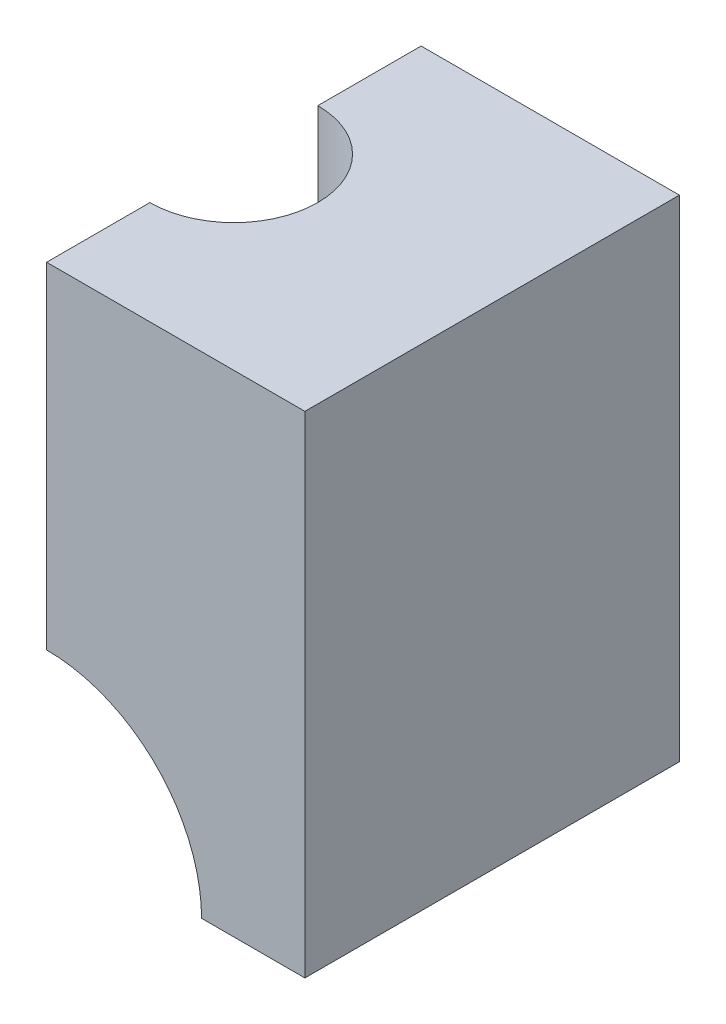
ISO-10303-21;
HEADER;
FILE_DESCRIPTION(('STEP AP214'),'2;1');
FILE_NAME('part.step','',(''),(''),'','','');
FILE_SCHEMA(('AUTOMOTIVE_DESIGN { 1 0 10303 214 1 1 1 1 }'));
ENDSEC;
DATA;
#1=APPLICATION_CONTEXT('core data for automotive mechanical design processes');
#2=APPLICATION_PROTOCOL_DEFINITION('international standard','automotive_design',2000,#1);
#3=PRODUCT_CONTEXT('',#1,'mechanical');
#4=PRODUCT('Part','Part','',(#3));
#5=PRODUCT_RELATED_PRODUCT_CATEGORY('part','',(#4));
#6=PRODUCT_DEFINITION_FORMATION('','',#4);
#7=PRODUCT_DEFINITION_CONTEXT('part definition',#1,'design');
#8=PRODUCT_DEFINITION('design','',#6,#7);
#9=PRODUCT_DEFINITION_SHAPE('','',#8);
#10=(LENGTH_UNIT() NAMED_UNIT(*) SI_UNIT(.MILLI.,.METRE.));
#11=(NAMED_UNIT(*) PLANE_ANGLE_UNIT() SI_UNIT($,.RADIAN.));
#12=(NAMED_UNIT(*) SI_UNIT($,.STERADIAN.) SOLID_ANGLE_UNIT());
#13=UNCERTAINTY_MEASURE_WITH_UNIT(LENGTH_MEASURE(1.E-05),#10,'distance_accuracy_value','');
#14=(GEOMETRIC_REPRESENTATION_CONTEXT(3) GLOBAL_UNCERTAINTY_ASSIGNED_CONTEXT((#13)) GLOBAL_UNIT_ASSIGNED_CONTEXT((#10,
#11,#12)) REPRESENTATION_CONTEXT('',''));
#15=CARTESIAN_POINT('',(0.,0.,0.));
#16=DIRECTION('',(0.,0.,1.));
#17=DIRECTION('',(1.,0.,0.));
#18=AXIS2_PLACEMENT_3D('',#15,#16,#17);
#19=CARTESIAN_POINT('',(-396.363758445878,77.7780315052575,458.902522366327));
#20=DIRECTION('',(1.,0.,0.));
#21=DIRECTION('',(0.,0.,-1.));
#22=AXIS2_PLACEMENT_3D('',#19,#20,#21);
#23=PLANE('',#22);
#24=DIRECTION('',(0.,0.,1.));
#25=VECTOR('',#24,1.);
#26=CARTESIAN_POINT('',(-396.363758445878,-182.221968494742,168.902522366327));
#27=LINE('',#26,#25);
#28=CARTESIAN_POINT('',(-396.363758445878,-182.221968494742,168.902522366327));
#29=VERTEX_POINT('',#28);
#30=CARTESIAN_POINT('',(-396.363758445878,-182.221968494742,248.902522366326));
#31=VERTEX_POINT('',#30);
#32=EDGE_CURVE('E27',#29,#31,#27,.T.);
#33=ORIENTED_EDGE('',*,*,#32,.T.);
#34=DIRECTION('',(0.,1.,0.));
#35=VECTOR('',#34,1.);
#36=CARTESIAN_POINT('',(-396.363758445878,-302.221968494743,248.902522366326));
#37=LINE('',#36,#35);
#38=CARTESIAN_POINT('',(-396.363758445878,77.7780315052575,248.902522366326));
#39=VERTEX_POINT('',#38);
#40=EDGE_CURVE('E34',#31,#39,#37,.T.);
#41=ORIENTED_EDGE('',*,*,#40,.T.);
#42=DIRECTION('',(0.,0.,1.));
#43=VECTOR('',#42,1.);
#44=CARTESIAN_POINT('',(-396.363758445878,77.7780315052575,168.902522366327));
#45=LINE('',#44,#43);
#46=CARTESIAN_POINT('',(-396.363758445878,77.7780315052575,168.902522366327));
#47=VERTEX_POINT('',#46);
#48=EDGE_CURVE('E88',#47,#39,#45,.T.);
#49=ORIENTED_EDGE('',*,*,#48,.F.);
#50=DIRECTION('',(0.,-1.,0.));
#51=VECTOR('',#50,1.);
#52=CARTESIAN_POINT('',(-396.363758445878,77.7780315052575,168.902522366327));
#53=LINE('',#52,#51);
#54=EDGE_CURVE('E95',#47,#29,#53,.T.);
#55=ORIENTED_EDGE('',*,*,#54,.T.);
#56=EDGE_LOOP('',(#33,#41,#49,#55));
#57=FACE_BOUND('',#56,.T.);
#58=ADVANCED_FACE('F14',(#57),#23,.F.);
#59=CARTESIAN_POINT('',(-196.363758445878,-302.221968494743,458.902522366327));
#60=DIRECTION('',(0.,0.,1.));
#61=DIRECTION('',(1.,0.,0.));
#62=AXIS2_PLACEMENT_3D('',#59,#60,#61);
#63=PLANE('',#62);
#64=CARTESIAN_POINT('',(-396.363758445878,-302.221968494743,458.902522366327));
#65=DIRECTION('',(0.,0.,1.));
#66=DIRECTION('',(1.,0.,0.));
#67=AXIS2_PLACEMENT_3D('',#64,#65,#66);
#68=CIRCLE('',#67,120.);
#69=CARTESIAN_POINT('',(-276.363758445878,-302.221968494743,458.902522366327));
#70=VERTEX_POINT('',#69);
#71=CARTESIAN_POINT('',(-396.363758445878,-182.221968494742,458.902522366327));
#72=VERTEX_POINT('',#71);
#73=EDGE_CURVE('E132',#70,#72,#68,.T.);
#74=ORIENTED_EDGE('',*,*,#73,.F.);
#75=DIRECTION('',(-1.,0.,0.));
#76=VECTOR('',#75,1.);
#77=CARTESIAN_POINT('',(-196.363758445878,-302.221968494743,458.902522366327));
#78=LINE('',#77,#76);
#79=CARTESIAN_POINT('',(-196.363758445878,-302.221968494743,458.902522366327));
#80=VERTEX_POINT('',#79);
#81=EDGE_CURVE('E113',#80,#70,#78,.T.);
#82=ORIENTED_EDGE('',*,*,#81,.F.);
#83=DIRECTION('',(0.,1.,0.));
#84=VECTOR('',#83,1.);
#85=CARTESIAN_POINT('',(-196.363758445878,-302.221968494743,458.902522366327));
#86=LINE('',#85,#84);
#87=CARTESIAN_POINT('',(-196.363758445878,77.7780315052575,458.902522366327));
#88=VERTEX_POINT('',#87);
#89=EDGE_CURVE('E102',#80,#88,#86,.T.);
#90=ORIENTED_EDGE('',*,*,#89,.T.);
#91=DIRECTION('',(-1.,0.,0.));
#92=VECTOR('',#91,1.);
#93=CARTESIAN_POINT('',(-196.363758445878,77.7780315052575,458.902522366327));
#94=LINE('',#93,#92);
#95=CARTESIAN_POINT('',(-396.363758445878,77.7780315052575,458.902522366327));
#96=VERTEX_POINT('',#95);
#97=EDGE_CURVE('E112',#88,#96,#94,.T.);
#98=ORIENTED_EDGE('',*,*,#97,.T.);
#99=DIRECTION('',(0.,1.,0.));
#100=VECTOR('',#99,1.);
#101=CARTESIAN_POINT('',(-396.363758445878,-302.221968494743,458.902522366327));
#102=LINE('',#101,#100);
#103=EDGE_CURVE('E92',#72,#96,#102,.T.);
#104=ORIENTED_EDGE('',*,*,#103,.F.);
#105=EDGE_LOOP('',(#74,#82,#90,#98,#104));
#106=FACE_BOUND('',#105,.T.);
#107=ADVANCED_FACE('F16',(#106),#63,.T.);
#108=CARTESIAN_POINT('',(-196.363758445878,-302.221968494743,458.902522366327));
#109=DIRECTION('',(0.,1.,0.));
#110=DIRECTION('',(0.,0.,-1.));
#111=AXIS2_PLACEMENT_3D('',#108,#109,#110);
#112=PLANE('',#111);
#113=ORIENTED_EDGE('',*,*,#81,.T.);
#114=DIRECTION('',(0.,0.,1.));
#115=VECTOR('',#114,1.);
#116=CARTESIAN_POINT('',(-276.363758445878,-302.221968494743,168.902522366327));
#117=LINE('',#116,#115);
#118=CARTESIAN_POINT('',(-276.363758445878,-302.221968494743,168.902522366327));
#119=VERTEX_POINT('',#118);
#120=EDGE_CURVE('E96',#70,#119,#117,.F.);
#121=ORIENTED_EDGE('',*,*,#120,.T.);
#122=DIRECTION('',(-1.,0.,0.));
#123=VECTOR('',#122,1.);
#124=CARTESIAN_POINT('',(-196.363758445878,-302.221968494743,168.902522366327));
#125=LINE('',#124,#123);
#126=CARTESIAN_POINT('',(-196.363758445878,-302.221968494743,168.902522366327));
#127=VERTEX_POINT('',#126);
#128=EDGE_CURVE('E116',#127,#119,#125,.T.);
#129=ORIENTED_EDGE('',*,*,#128,.F.);
#130=DIRECTION('',(0.,0.,-1.));
#131=VECTOR('',#130,1.);
#132=CARTESIAN_POINT('',(-196.363758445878,-302.221968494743,458.902522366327));
#133=LINE('',#132,#131);
#134=EDGE_CURVE('E110',#80,#127,#133,.T.);
#135=ORIENTED_EDGE('',*,*,#134,.F.);
#136=EDGE_LOOP('',(#113,#121,#129,#135));
#137=FACE_BOUND('',#136,.T.);
#138=ADVANCED_FACE('F145',(#137),#112,.F.);
#139=CARTESIAN_POINT('',(-196.363758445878,77.7780315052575,168.902522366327));
#140=DIRECTION('',(0.,0.,-1.));
#141=DIRECTION('',(0.,-1.,0.));
#142=AXIS2_PLACEMENT_3D('',#139,#140,#141);
#143=PLANE('',#142);
#144=CARTESIAN_POINT('',(-396.363758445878,-302.221968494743,168.902522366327));
#145=DIRECTION('',(0.,0.,1.));
#146=DIRECTION('',(1.,0.,0.));
#147=AXIS2_PLACEMENT_3D('',#144,#145,#146);
#148=CIRCLE('',#147,120.);
#149=EDGE_CURVE('E127',#119,#29,#148,.T.);
#150=ORIENTED_EDGE('',*,*,#149,.T.);
#151=ORIENTED_EDGE('',*,*,#54,.F.);
#152=DIRECTION('',(-1.,0.,0.));
#153=VECTOR('',#152,1.);
#154=CARTESIAN_POINT('',(-196.363758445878,77.7780315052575,168.902522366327));
#155=LINE('',#154,#153);
#156=CARTESIAN_POINT('',(-196.363758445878,77.7780315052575,168.902522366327));
#157=VERTEX_POINT('',#156);
#158=EDGE_CURVE('E119',#157,#47,#155,.T.);
#159=ORIENTED_EDGE('',*,*,#158,.F.);
#160=DIRECTION('',(0.,-1.,0.));
#161=VECTOR('',#160,1.);
#162=CARTESIAN_POINT('',(-196.363758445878,77.7780315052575,168.902522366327));
#163=LINE('',#162,#161);
#164=EDGE_CURVE('E107',#157,#127,#163,.T.);
#165=ORIENTED_EDGE('',*,*,#164,.T.);
#166=ORIENTED_EDGE('',*,*,#128,.T.);
#167=EDGE_LOOP('',(#150,#151,#159,#165,#166));
#168=FACE_BOUND('',#167,.T.);
#169=ADVANCED_FACE('F130',(#168),#143,.T.);
#170=CARTESIAN_POINT('',(-196.363758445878,77.7780315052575,168.902522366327));
#171=DIRECTION('',(0.,-1.,0.));
#172=DIRECTION('',(1.,0.,0.));
#173=AXIS2_PLACEMENT_3D('',#170,#171,#172);
#174=PLANE('',#173);
#175=ORIENTED_EDGE('',*,*,#48,.T.);
#176=CARTESIAN_POINT('',(-396.363758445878,77.7780315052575,313.902522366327));
#177=DIRECTION('',(0.,1.,0.));
#178=DIRECTION('',(-1.,0.,0.));
#179=AXIS2_PLACEMENT_3D('',#176,#177,#178);
#180=CIRCLE('',#179,65.);
#181=CARTESIAN_POINT('',(-396.363758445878,77.7780315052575,378.902522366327));
#182=VERTEX_POINT('',#181);
#183=EDGE_CURVE('E79',#182,#39,#180,.T.);
#184=ORIENTED_EDGE('',*,*,#183,.F.);
#185=EDGE_CURVE('E86',#182,#96,#45,.T.);
#186=ORIENTED_EDGE('',*,*,#185,.T.);
#187=ORIENTED_EDGE('',*,*,#97,.F.);
#188=DIRECTION('',(0.,0.,1.));
#189=VECTOR('',#188,1.);
#190=CARTESIAN_POINT('',(-196.363758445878,77.7780315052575,168.902522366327));
#191=LINE('',#190,#189);
#192=EDGE_CURVE('E105',#157,#88,#191,.T.);
#193=ORIENTED_EDGE('',*,*,#192,.F.);
#194=ORIENTED_EDGE('',*,*,#158,.T.);
#195=EDGE_LOOP('',(#175,#184,#186,#187,#193,#194));
#196=FACE_BOUND('',#195,.T.);
#197=ADVANCED_FACE('F84',(#196),#174,.F.);
#198=CARTESIAN_POINT('',(-196.363758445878,77.7780315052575,458.902522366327));
#199=DIRECTION('',(1.,0.,0.));
#200=DIRECTION('',(0.,0.,-1.));
#201=AXIS2_PLACEMENT_3D('',#198,#199,#200);
#202=PLANE('',#201);
#203=ORIENTED_EDGE('',*,*,#89,.F.);
#204=ORIENTED_EDGE('',*,*,#134,.T.);
#205=ORIENTED_EDGE('',*,*,#164,.F.);
#206=ORIENTED_EDGE('',*,*,#192,.T.);
#207=EDGE_LOOP('',(#203,#204,#205,#206));
#208=FACE_BOUND('',#207,.T.);
#209=ADVANCED_FACE('F142',(#208),#202,.T.);
#210=ORIENTED_EDGE('',*,*,#185,.F.);
#211=DIRECTION('',(0.,1.,0.));
#212=VECTOR('',#211,1.);
#213=CARTESIAN_POINT('',(-396.363758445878,-302.221968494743,378.902522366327));
#214=LINE('',#213,#212);
#215=CARTESIAN_POINT('',(-396.363758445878,-182.221968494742,378.902522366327));
#216=VERTEX_POINT('',#215);
#217=EDGE_CURVE('E76',#182,#216,#214,.F.);
#218=ORIENTED_EDGE('',*,*,#217,.T.);
#219=EDGE_CURVE('E41',#216,#72,#27,.T.);
#220=ORIENTED_EDGE('',*,*,#219,.T.);
#221=ORIENTED_EDGE('',*,*,#103,.T.);
#222=EDGE_LOOP('',(#210,#218,#220,#221));
#223=FACE_BOUND('',#222,.T.);
#224=ADVANCED_FACE('F90',(#223),#23,.F.);
#225=CARTESIAN_POINT('',(-396.363758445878,-302.221968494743,168.902522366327));
#226=DIRECTION('',(0.,0.,1.));
#227=DIRECTION('',(1.,0.,0.));
#228=AXIS2_PLACEMENT_3D('',#225,#226,#227);
#229=CYLINDRICAL_SURFACE('',#228,120.);
#230=ORIENTED_EDGE('',*,*,#219,.F.);
#231=CARTESIAN_POINT('',(-461.363758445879,-201.350763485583,313.902522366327));
#232=CARTESIAN_POINT('',(-461.363759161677,-201.35076442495,314.738076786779));
#233=CARTESIAN_POINT('',(-461.347642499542,-201.340373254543,315.573614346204));
#234=CARTESIAN_POINT('',(-461.283238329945,-201.298915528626,317.243020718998));
#235=CARTESIAN_POINT('',(-461.234947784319,-201.267847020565,318.076889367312));
#236=CARTESIAN_POINT('',(-461.106365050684,-201.185337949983,319.741341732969));
#237=CARTESIAN_POINT('',(-461.026065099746,-201.133892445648,320.57192460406));
#238=CARTESIAN_POINT('',(-460.833759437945,-201.011139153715,322.228023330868));
#239=CARTESIAN_POINT('',(-460.721750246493,-200.939829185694,323.053538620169));
#240=CARTESIAN_POINT('',(-460.466263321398,-200.777935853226,324.698956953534));
#241=CARTESIAN_POINT('',(-460.322742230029,-200.687325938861,325.518850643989));
#242=CARTESIAN_POINT('',(-460.004808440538,-200.487746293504,327.150453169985));
#243=CARTESIAN_POINT('',(-459.830392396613,-200.378774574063,327.962161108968));
#244=CARTESIAN_POINT('',(-459.451281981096,-200.143497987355,329.575781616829));
#245=CARTESIAN_POINT('',(-459.246593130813,-200.017196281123,330.377695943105));
#246=CARTESIAN_POINT('',(-458.807542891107,-199.748362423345,331.970633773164));
#247=CARTESIAN_POINT('',(-458.573178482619,-199.605828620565,332.761656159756));
#248=CARTESIAN_POINT('',(-457.829652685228,-199.157531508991,335.106794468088));
#249=CARTESIAN_POINT('',(-457.277612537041,-198.829534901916,336.643344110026));
#250=CARTESIAN_POINT('',(-456.064380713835,-198.124286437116,339.660650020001));
#251=CARTESIAN_POINT('',(-455.403187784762,-197.747034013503,341.141405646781));
#252=CARTESIAN_POINT('',(-453.976861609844,-196.953758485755,344.041218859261));
#253=CARTESIAN_POINT('',(-453.211723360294,-196.537733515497,345.460273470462));
#254=CARTESIAN_POINT('',(-451.582525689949,-195.677441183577,348.231397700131));
#255=CARTESIAN_POINT('',(-450.718461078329,-195.233172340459,349.583463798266));
#256=CARTESIAN_POINT('',(-448.806793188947,-194.282280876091,352.34490919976));
#257=CARTESIAN_POINT('',(-447.749504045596,-193.7738101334,353.746955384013));
#258=CARTESIAN_POINT('',(-445.526798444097,-192.748256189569,356.459191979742));
#259=CARTESIAN_POINT('',(-444.361376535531,-192.231172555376,357.769377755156));
#260=CARTESIAN_POINT('',(-441.92700399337,-191.200627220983,360.292881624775));
#261=CARTESIAN_POINT('',(-440.657997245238,-190.68716764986,361.506146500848));
#262=CARTESIAN_POINT('',(-438.022401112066,-189.676198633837,363.828904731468));
#263=CARTESIAN_POINT('',(-436.655808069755,-189.178689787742,364.938394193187));
#264=CARTESIAN_POINT('',(-433.713474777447,-188.171057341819,367.134465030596));
#265=CARTESIAN_POINT('',(-432.129785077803,-187.663295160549,368.211557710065));
#266=CARTESIAN_POINT('',(-429.680191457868,-186.936486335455,369.723101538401));
#267=CARTESIAN_POINT('',(-428.851149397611,-186.699980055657,370.209684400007));
#268=CARTESIAN_POINT('',(-427.169506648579,-186.240223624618,371.147016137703));
#269=CARTESIAN_POINT('',(-426.316908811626,-186.016971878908,371.597769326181));
#270=CARTESIAN_POINT('',(-424.589845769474,-185.585438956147,372.462065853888));
#271=CARTESIAN_POINT('',(-423.715390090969,-185.377151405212,372.875625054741));
#272=CARTESIAN_POINT('',(-421.945830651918,-184.977010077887,373.664515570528));
#273=CARTESIAN_POINT('',(-421.050729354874,-184.785154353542,374.03985141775));
#274=CARTESIAN_POINT('',(-419.241462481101,-184.419326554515,374.751149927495));
#275=CARTESIAN_POINT('',(-418.327297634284,-184.24535379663,375.087114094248));
#276=CARTESIAN_POINT('',(-416.481685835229,-183.916653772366,375.718541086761));
#277=CARTESIAN_POINT('',(-415.55023927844,-183.761926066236,376.014004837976));
#278=CARTESIAN_POINT('',(-413.748291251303,-183.484694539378,376.541058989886));
#279=CARTESIAN_POINT('',(-412.878981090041,-183.360594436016,376.77588754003));
#280=CARTESIAN_POINT('',(-411.128999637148,-183.130547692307,377.209712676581));
#281=CARTESIAN_POINT('',(-410.248327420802,-183.024602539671,377.40870632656));
#282=CARTESIAN_POINT('',(-408.477524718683,-182.831642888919,377.770144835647));
#283=CARTESIAN_POINT('',(-407.587394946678,-182.744626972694,377.932592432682));
#284=CARTESIAN_POINT('',(-405.799474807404,-182.59014846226,378.220382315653));
#285=CARTESIAN_POINT('',(-404.901684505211,-182.522685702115,378.345724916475));
#286=CARTESIAN_POINT('',(-403.100870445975,-182.407842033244,378.558790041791));
#287=CARTESIAN_POINT('',(-402.197849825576,-182.360450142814,378.646533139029));
#288=CARTESIAN_POINT('',(-400.388187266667,-182.28605237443,378.784163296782));
#289=CARTESIAN_POINT('',(-399.48154573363,-182.259044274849,378.834054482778));
#290=CARTESIAN_POINT('',(-397.666597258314,-182.225608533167,378.895807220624));
#291=CARTESIAN_POINT('',(-396.758290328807,-182.219180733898,378.907669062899));
#292=CARTESIAN_POINT('',(-394.942079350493,-182.226954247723,378.893317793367));
#293=CARTESIAN_POINT('',(-394.034175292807,-182.241155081,378.867105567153));
#294=CARTESIAN_POINT('',(-392.313199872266,-182.287583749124,378.781315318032));
#295=CARTESIAN_POINT('',(-391.499889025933,-182.317827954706,378.725408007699));
#296=CARTESIAN_POINT('',(-389.876646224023,-182.39468594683,378.583131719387));
#297=CARTESIAN_POINT('',(-389.066714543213,-182.441301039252,378.496760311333));
#298=CARTESIAN_POINT('',(-387.451869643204,-182.550614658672,378.293828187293));
#299=CARTESIAN_POINT('',(-386.646955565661,-182.613310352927,378.177272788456));
#300=CARTESIAN_POINT('',(-385.043381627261,-182.754410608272,377.914314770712));
#301=CARTESIAN_POINT('',(-384.244722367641,-182.832816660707,377.767909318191));
#302=CARTESIAN_POINT('',(-381.860276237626,-183.090937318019,377.284521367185));
#303=CARTESIAN_POINT('',(-380.285642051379,-183.293580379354,376.903319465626));
#304=CARTESIAN_POINT('',(-377.177064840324,-183.755341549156,376.02723495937));
#305=CARTESIAN_POINT('',(-375.643123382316,-184.014461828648,375.532347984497));
#306=CARTESIAN_POINT('',(-372.60737816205,-184.586740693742,374.427497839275));
#307=CARTESIAN_POINT('',(-371.106134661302,-184.900477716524,373.816295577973));
#308=CARTESIAN_POINT('',(-368.161884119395,-185.573200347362,372.488040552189));
#309=CARTESIAN_POINT('',(-366.718876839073,-185.932185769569,371.770988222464));
#310=CARTESIAN_POINT('',(-363.897332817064,-186.688142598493,370.236444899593));
#311=CARTESIAN_POINT('',(-362.518810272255,-187.085122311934,369.418931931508));
#312=CARTESIAN_POINT('',(-359.832091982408,-187.909185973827,367.689050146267));
#313=CARTESIAN_POINT('',(-358.523900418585,-188.336271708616,366.776675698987));
#314=CARTESIAN_POINT('',(-355.848192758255,-189.258711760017,364.760986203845));
#315=CARTESIAN_POINT('',(-354.48903439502,-189.756509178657,363.647682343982));
#316=CARTESIAN_POINT('',(-351.868253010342,-190.76738972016,361.317968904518));
#317=CARTESIAN_POINT('',(-350.606635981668,-191.280473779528,360.101552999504));
#318=CARTESIAN_POINT('',(-348.185126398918,-192.310403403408,357.570471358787));
#319=CARTESIAN_POINT('',(-347.025329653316,-192.827252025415,356.2557151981));
#320=CARTESIAN_POINT('',(-344.814044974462,-193.851713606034,353.534588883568));
#321=CARTESIAN_POINT('',(-343.762561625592,-194.359326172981,352.12821485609));
#322=CARTESIAN_POINT('',(-341.690311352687,-195.39376465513,349.108243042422));
#323=CARTESIAN_POINT('',(-340.6794700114,-195.918646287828,347.487151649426));
#324=CARTESIAN_POINT('',(-338.799248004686,-196.924937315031,344.151344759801));
#325=CARTESIAN_POINT('',(-337.929878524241,-197.406343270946,342.436621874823));
#326=CARTESIAN_POINT('',(-336.739120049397,-198.082107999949,339.802921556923));
#327=CARTESIAN_POINT('',(-336.361175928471,-198.299582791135,338.915017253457));
#328=CARTESIAN_POINT('',(-335.64394998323,-198.717007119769,337.119731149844));
#329=CARTESIAN_POINT('',(-335.304663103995,-198.916958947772,336.212351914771));
#330=CARTESIAN_POINT('',(-334.66586855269,-199.297197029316,334.379636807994));
#331=CARTESIAN_POINT('',(-334.366361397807,-199.477483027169,333.454300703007));
#332=CARTESIAN_POINT('',(-333.808280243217,-199.816310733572,331.587570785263));
#333=CARTESIAN_POINT('',(-333.54969994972,-199.974855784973,330.646179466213));
#334=CARTESIAN_POINT('',(-333.093710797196,-200.25645012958,328.825952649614));
#335=CARTESIAN_POINT('',(-332.893046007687,-200.38133313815,327.948215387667));
#336=CARTESIAN_POINT('',(-332.527936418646,-200.609792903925,326.182601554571));
#337=CARTESIAN_POINT('',(-332.363486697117,-200.713372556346,325.294726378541));
#338=CARTESIAN_POINT('',(-332.071440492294,-200.898093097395,323.510590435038));
#339=CARTESIAN_POINT('',(-331.943844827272,-200.979233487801,322.614329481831));
#340=CARTESIAN_POINT('',(-331.726059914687,-201.118137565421,320.815463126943));
#341=CARTESIAN_POINT('',(-331.635870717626,-201.175901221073,319.912857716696));
#342=CARTESIAN_POINT('',(-331.493367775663,-201.267327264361,318.104250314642));
#343=CARTESIAN_POINT('',(-331.44102042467,-201.30101103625,317.198252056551));
#344=CARTESIAN_POINT('',(-331.374312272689,-201.343955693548,315.384281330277));
#345=CARTESIAN_POINT('',(-331.359951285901,-201.353216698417,314.476308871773));
#346=CARTESIAN_POINT('',(-331.369281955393,-201.347204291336,312.660717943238));
#347=CARTESIAN_POINT('',(-331.392970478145,-201.331932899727,311.753099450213));
#348=CARTESIAN_POINT('',(-331.478282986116,-201.277044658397,309.940411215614));
#349=CARTESIAN_POINT('',(-331.539905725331,-201.237428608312,309.035341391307));
#350=CARTESIAN_POINT('',(-331.689600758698,-201.141505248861,307.355623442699));
#351=CARTESIAN_POINT('',(-331.772796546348,-201.088289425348,306.580359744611));
#352=CARTESIAN_POINT('',(-331.966802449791,-200.964647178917,305.03465605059));
#353=CARTESIAN_POINT('',(-332.07761479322,-200.894219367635,304.264216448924));
#354=CARTESIAN_POINT('',(-332.450938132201,-200.658000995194,301.962418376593));
#355=CARTESIAN_POINT('',(-332.75438782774,-200.46724140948,300.439996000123));
#356=CARTESIAN_POINT('',(-333.466915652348,-200.025284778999,297.428817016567));
#357=CARTESIAN_POINT('',(-333.876028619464,-199.774067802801,295.940071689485));
#358=CARTESIAN_POINT('',(-334.795657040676,-199.21877832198,293.004315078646));
#359=CARTESIAN_POINT('',(-335.306179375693,-198.914702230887,291.557306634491));
#360=CARTESIAN_POINT('',(-336.448307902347,-198.24796000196,288.650148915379));
#361=CARTESIAN_POINT('',(-337.084194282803,-197.883329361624,287.192135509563));
#362=CARTESIAN_POINT('',(-338.456395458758,-197.11556924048,284.334813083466));
#363=CARTESIAN_POINT('',(-339.192711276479,-196.712439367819,282.935504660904));
#364=CARTESIAN_POINT('',(-340.761332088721,-195.877435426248,280.20004440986));
#365=CARTESIAN_POINT('',(-341.593673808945,-195.445550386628,278.863917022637));
#366=CARTESIAN_POINT('',(-343.349760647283,-194.562868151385,276.259688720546));
#367=CARTESIAN_POINT('',(-344.273512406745,-194.112069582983,274.991592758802));
#368=CARTESIAN_POINT('',(-346.356343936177,-193.131282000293,272.339077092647));
#369=CARTESIAN_POINT('',(-347.529811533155,-192.599721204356,270.966505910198));
#370=CARTESIAN_POINT('',(-349.987109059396,-191.537742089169,268.323329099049));
#371=CARTESIAN_POINT('',(-351.270948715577,-191.007323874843,267.052732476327));
#372=CARTESIAN_POINT('',(-353.94384339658,-189.960612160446,264.619471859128));
#373=CARTESIAN_POINT('',(-355.332954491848,-189.444326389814,263.456866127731));
#374=CARTESIAN_POINT('',(-358.209914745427,-188.438820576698,261.247298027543));
#375=CARTESIAN_POINT('',(-359.69776413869,-187.949600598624,260.200335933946));
#376=CARTESIAN_POINT('',(-362.033175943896,-187.23450842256,258.699979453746));
#377=CARTESIAN_POINT('',(-362.847796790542,-186.994286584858,258.201578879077));
#378=CARTESIAN_POINT('',(-364.500867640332,-186.526274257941,257.23974550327));
#379=CARTESIAN_POINT('',(-365.339315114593,-186.298482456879,256.776309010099));
#380=CARTESIAN_POINT('',(-367.03894910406,-185.856910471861,255.885487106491));
#381=CARTESIAN_POINT('',(-367.90013975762,-185.643132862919,255.4581083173));
#382=CARTESIAN_POINT('',(-369.643617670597,-185.231215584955,254.640722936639));
#383=CARTESIAN_POINT('',(-370.525902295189,-185.033073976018,254.250711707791));
#384=CARTESIAN_POINT('',(-372.309507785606,-184.654015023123,253.509434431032));
#385=CARTESIAN_POINT('',(-373.210815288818,-184.473086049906,253.158142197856));
#386=CARTESIAN_POINT('',(-375.031230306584,-184.129711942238,252.495181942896));
#387=CARTESIAN_POINT('',(-375.95033560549,-183.967264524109,252.183509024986));
#388=CARTESIAN_POINT('',(-377.804536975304,-183.662118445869,251.600839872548));
#389=CARTESIAN_POINT('',(-378.739632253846,-183.519418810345,251.329841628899));
#390=CARTESIAN_POINT('',(-380.623814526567,-183.254918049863,250.829515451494));
#391=CARTESIAN_POINT('',(-381.572901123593,-183.133116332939,250.600186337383));
#392=CARTESIAN_POINT('',(-383.386888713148,-182.922560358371,250.205004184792));
#393=CARTESIAN_POINT('',(-384.250664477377,-182.831715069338,250.035088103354));
#394=CARTESIAN_POINT('',(-385.986171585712,-182.668359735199,249.730239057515));
#395=CARTESIAN_POINT('',(-386.857903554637,-182.595851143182,249.595308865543));
#396=CARTESIAN_POINT('',(-388.607395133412,-182.469691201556,249.360925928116));
#397=CARTESIAN_POINT('',(-389.48515414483,-182.416038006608,249.261469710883));
#398=CARTESIAN_POINT('',(-391.244952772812,-182.327957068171,249.098365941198));
#399=CARTESIAN_POINT('',(-392.126992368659,-182.293529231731,249.03471821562));
#400=CARTESIAN_POINT('',(-393.893164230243,-182.244152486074,248.943475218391));
#401=CARTESIAN_POINT('',(-394.777295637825,-182.22919663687,248.915867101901));
#402=CARTESIAN_POINT('',(-396.545973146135,-182.218848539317,248.89676213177));
#403=CARTESIAN_POINT('',(-397.430519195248,-182.223454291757,248.905261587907));
#404=CARTESIAN_POINT('',(-399.198220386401,-182.252192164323,248.958333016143));
#405=CARTESIAN_POINT('',(-400.081375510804,-182.276324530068,249.002905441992));
#406=CARTESIAN_POINT('',(-401.844379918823,-182.343943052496,249.127961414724));
#407=CARTESIAN_POINT('',(-402.724229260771,-182.387428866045,249.208444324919));
#408=CARTESIAN_POINT('',(-404.403847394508,-182.488919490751,249.396640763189));
#409=CARTESIAN_POINT('',(-405.204037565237,-182.545367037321,249.50144146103));
#410=CARTESIAN_POINT('',(-406.798760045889,-182.673856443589,249.740530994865));
#411=CARTESIAN_POINT('',(-407.593291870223,-182.745899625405,249.874822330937));
#412=CARTESIAN_POINT('',(-409.966113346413,-182.98480730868,250.321355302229));
#413=CARTESIAN_POINT('',(-411.534165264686,-183.174482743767,250.67731623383));
#414=CARTESIAN_POINT('',(-414.632123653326,-183.6103527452,251.50190103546));
#415=CARTESIAN_POINT('',(-416.162027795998,-183.85655075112,251.97053176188));
#416=CARTESIAN_POINT('',(-419.175137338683,-184.400134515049,253.015874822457));
#417=CARTESIAN_POINT('',(-420.658340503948,-184.697522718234,253.592592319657));
#418=CARTESIAN_POINT('',(-423.622718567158,-185.348813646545,254.871614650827));
#419=CARTESIAN_POINT('',(-425.101902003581,-185.704364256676,255.577690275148));
#420=CARTESIAN_POINT('',(-427.994701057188,-186.456182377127,257.094503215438));
#421=CARTESIAN_POINT('',(-429.408315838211,-186.852450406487,257.905241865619));
#422=CARTESIAN_POINT('',(-432.164384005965,-187.677718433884,259.625867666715));
#423=CARTESIAN_POINT('',(-433.506815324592,-188.106728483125,260.535785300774));
#424=CARTESIAN_POINT('',(-436.11496167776,-188.988857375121,262.449066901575));
#425=CARTESIAN_POINT('',(-437.380672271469,-189.441977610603,263.45243626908));
#426=CARTESIAN_POINT('',(-439.969095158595,-190.415458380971,265.665690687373));
#427=CARTESIAN_POINT('',(-441.282135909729,-190.937638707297,266.886104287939));
#428=CARTESIAN_POINT('',(-443.801918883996,-191.988195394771,269.429761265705));
#429=CARTESIAN_POINT('',(-445.00865306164,-192.516572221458,270.753012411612));
#430=CARTESIAN_POINT('',(-447.311487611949,-193.566861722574,273.497802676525));
#431=CARTESIAN_POINT('',(-448.407460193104,-194.088766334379,274.919452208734));
#432=CARTESIAN_POINT('',(-450.481225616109,-195.111573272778,277.853557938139));
#433=CARTESIAN_POINT('',(-451.459018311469,-195.612475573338,279.366014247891));
#434=CARTESIAN_POINT('',(-453.34533970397,-196.608028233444,282.569513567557));
#435=CARTESIAN_POINT('',(-454.246149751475,-197.100485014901,284.265826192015));
#436=CARTESIAN_POINT('',(-455.485797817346,-197.795874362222,286.8745248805));
#437=CARTESIAN_POINT('',(-455.880505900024,-198.020506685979,287.755029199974));
#438=CARTESIAN_POINT('',(-456.631623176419,-198.453127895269,289.53618887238));
#439=CARTESIAN_POINT('',(-456.98803740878,-198.661118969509,290.436841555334));
#440=CARTESIAN_POINT('',(-457.660549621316,-199.057752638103,292.25442853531));
#441=CARTESIAN_POINT('',(-457.97675189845,-199.246445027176,293.171313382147));
#442=CARTESIAN_POINT('',(-458.568785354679,-199.602993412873,295.021891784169));
#443=CARTESIAN_POINT('',(-458.844622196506,-199.770852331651,295.955582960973));
#444=CARTESIAN_POINT('',(-459.354762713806,-200.083714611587,297.837547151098));
#445=CARTESIAN_POINT('',(-459.589086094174,-200.22872881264,298.785813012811));
#446=CARTESIAN_POINT('',(-460.015313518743,-200.494181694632,300.695096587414));
#447=CARTESIAN_POINT('',(-460.207224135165,-200.614624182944,301.656112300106));
#448=CARTESIAN_POINT('',(-460.540835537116,-200.825025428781,303.549325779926));
#449=CARTESIAN_POINT('',(-460.684262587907,-200.916025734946,304.481103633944));
#450=CARTESIAN_POINT('',(-460.930601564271,-201.072850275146,306.351854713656));
#451=CARTESIAN_POINT('',(-461.033524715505,-201.138681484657,307.290825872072));
#452=CARTESIAN_POINT('',(-461.198416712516,-201.244363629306,309.173847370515));
#453=CARTESIAN_POINT('',(-461.260384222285,-201.284213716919,310.117897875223));
#454=CARTESIAN_POINT('',(-461.343060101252,-201.337416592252,312.008813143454));
#455=CARTESIAN_POINT('',(-461.363757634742,-201.350762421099,312.955678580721));
#456=CARTESIAN_POINT('',(-461.363758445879,-201.350763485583,313.902522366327));
#457=B_SPLINE_CURVE_WITH_KNOTS('',3,(#231,#232,#233,#234,#235,#236,#237,#238,#239,#240,#241,
#242,#243,#244,#245,#246,#247,#248,#249,#250,#251,#252,#253,#254,#255,#256,#257,#258,#259,#260,
#261,#262,#263,#264,#265,#266,#267,#268,#269,#270,#271,#272,#273,#274,#275,#276,#277,#278,#279,
#280,#281,#282,#283,#284,#285,#286,#287,#288,#289,#290,#291,#292,#293,#294,#295,#296,#297,#298,
#299,#300,#301,#302,#303,#304,#305,#306,#307,#308,#309,#310,#311,#312,#313,#314,#315,#316,#317,
#318,#319,#320,#321,#322,#323,#324,#325,#326,#327,#328,#329,#330,#331,#332,#333,#334,#335,#336,
#337,#338,#339,#340,#341,#342,#343,#344,#345,#346,#347,#348,#349,#350,#351,#352,#353,#354,#355,
#356,#357,#358,#359,#360,#361,#362,#363,#364,#365,#366,#367,#368,#369,#370,#371,#372,#373,#374,
#375,#376,#377,#378,#379,#380,#381,#382,#383,#384,#385,#386,#387,#388,#389,#390,#391,#392,#393,
#394,#395,#396,#397,#398,#399,#400,#401,#402,#403,#404,#405,#406,#407,#408,#409,#410,#411,#412,
#413,#414,#415,#416,#417,#418,#419,#420,#421,#422,#423,#424,#425,#426,#427,#428,#429,#430,#431,
#432,#433,#434,#435,#436,#437,#438,#439,#440,#441,#442,#443,#444,#445,#446,#447,#448,#449,#450,
#451,#452,#453,#454,#455,#456),.UNSPECIFIED.,.T.,.F.,(4,2,2,2,2,2,2,2,2,2,2,2,2,2,2,2,2,2,2,2,2,
2,2,2,2,2,2,2,2,2,2,2,2,2,2,2,2,2,2,2,2,2,2,2,2,2,2,2,2,2,2,2,2,2,2,2,2,2,2,2,2,2,2,2,2,2,2,2,2,
2,2,2,2,2,2,2,2,2,2,2,2,2,2,2,2,2,2,2,2,2,2,2,2,2,2,2,2,2,2,2,2,2,2,2,2,2,2,2,2,2,2,2,4),(0.,
2.5064147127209,5.01306613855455,7.52032584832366,10.0278608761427,12.5388679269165,
15.0501470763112,17.5609687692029,20.072046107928,25.0620288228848,30.0520688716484,
35.042349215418,40.0328915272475,45.511654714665,50.9906942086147,56.4727217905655,
61.9549549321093,67.890730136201,70.8597675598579,73.8284470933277,76.7958545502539,
79.7629097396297,82.7298515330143,85.6967255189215,88.4227349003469,91.1489675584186,
93.8749959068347,96.6010011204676,99.3255128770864,102.049727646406,104.773921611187,
107.498052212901,109.944695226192,112.391533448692,114.837940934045,117.284580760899,
122.176715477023,127.069038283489,132.016734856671,136.964411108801,141.913171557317,
146.862225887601,152.334681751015,157.807473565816,163.285361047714,168.763480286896,
174.699806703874,180.63660222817,183.603288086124,186.569585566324,189.535921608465,
192.501801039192,195.227814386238,197.953457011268,200.679160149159,203.404866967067,
206.128150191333,208.851420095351,211.574465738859,214.297421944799,216.641299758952,
218.985366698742,223.671742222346,228.359664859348,233.047905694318,237.93880788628,
242.82975986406,247.722588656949,252.615773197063,258.256915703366,263.898555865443,
269.543222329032,275.18790222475,278.141305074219,281.094395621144,284.048027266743,
287.001291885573,289.95254682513,292.903436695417,295.854180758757,298.804841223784,
301.458963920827,304.113296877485,306.767369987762,309.421430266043,312.074544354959,
314.727387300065,317.380263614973,320.033092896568,322.459347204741,324.88580727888,
329.737110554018,334.588709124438,339.440539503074,344.46686682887,349.493258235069,
354.521198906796,359.549430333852,365.144772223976,370.740537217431,376.342686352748,
381.944842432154,387.884409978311,390.855712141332,393.826622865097,396.789663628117,
399.752288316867,402.713502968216,405.674258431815,408.514457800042,411.353869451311,
414.193373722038,417.033623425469),.UNSPECIFIED.);
#458=EDGE_CURVE('E9',#216,#31,#457,.T.);
#459=ORIENTED_EDGE('',*,*,#458,.T.);
#460=ORIENTED_EDGE('',*,*,#32,.F.);
#461=ORIENTED_EDGE('',*,*,#149,.F.);
#462=ORIENTED_EDGE('',*,*,#120,.F.);
#463=ORIENTED_EDGE('',*,*,#73,.T.);
#464=EDGE_LOOP('',(#230,#459,#460,#461,#462,#463));
#465=FACE_BOUND('',#464,.T.);
#466=ADVANCED_FACE('F126',(#465),#229,.F.);
#467=CARTESIAN_POINT('',(-396.363758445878,-302.221968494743,313.902522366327));
#468=DIRECTION('',(0.,1.,0.));
#469=DIRECTION('',(-1.,0.,0.));
#470=AXIS2_PLACEMENT_3D('',#467,#468,#469);
#471=CYLINDRICAL_SURFACE('',#470,65.);
#472=ORIENTED_EDGE('',*,*,#458,.F.);
#473=ORIENTED_EDGE('',*,*,#217,.F.);
#474=ORIENTED_EDGE('',*,*,#183,.T.);
#475=ORIENTED_EDGE('',*,*,#40,.F.);
#476=EDGE_LOOP('',(#472,#473,#474,#475));
#477=FACE_BOUND('',#476,.T.);
#478=ADVANCED_FACE('F78',(#477),#471,.F.);
#479=CLOSED_SHELL('',(#58,#107,#138,#169,#197,#209,#224,#466,#478));
#480=MANIFOLD_SOLID_BREP('B1',#479);
#481=ADVANCED_BREP_SHAPE_REPRESENTATION('',(#18,#480),#14);
#482=SHAPE_DEFINITION_REPRESENTATION(#9,#481);
ENDSEC;
END-ISO-10303-21;
